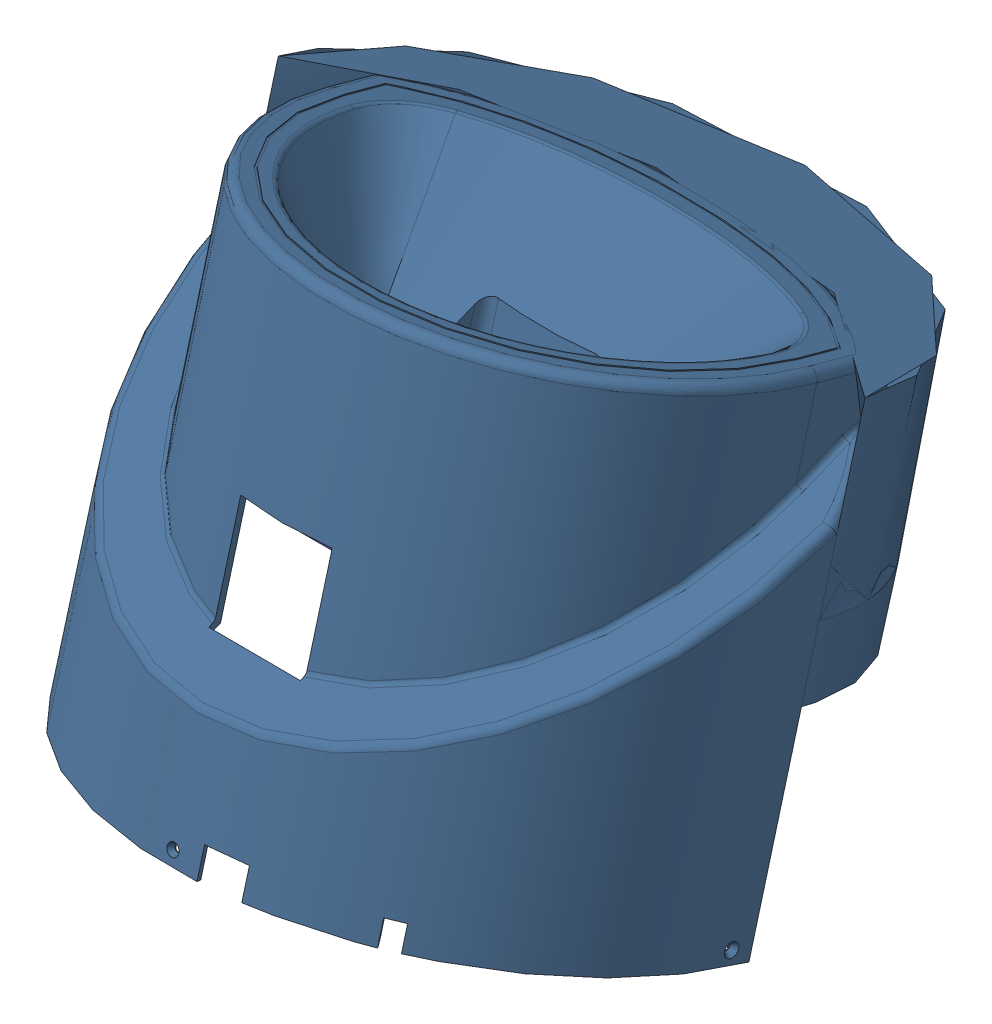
SolidWorks assembly Trieur de pièces.SLDASM, configuration Défaut (file format 12000). Lengths in mm.
Overall size (138 76.71 121.86).
26 component instances, 17 part files, 12 mates.
Components (placement in the parent):
- Sous ensemble fixe-1: Sous ensemble fixe.SLDASM [Défaut] at origin size (333.57 313.9 348.88)
  - 01 - Support-1: 01 - Support.SLDPRT [Défaut] at origin size (111.5 42.98 115)
  - 03a - Moteur-1: 03a - Moteur.SLDPRT [Défaut] at (53 -9 -55) x (0 -0.707107 -0.707107) z (1 0 0) size (24 24 36)
  - 04 - Embase moteur-1: 04 - Embase moteur.SLDPRT [Défaut] at (53 -9 -55) x (0 0.707107 0.707107) z (-1 0 0) size (38 24 2.5)
  - 05 - Vis à tête fraisée-1: 05 - Vis à tête fraisée.SLDPRT [ST 2,2 - 5,5 C] at (52 -4.0503 -50.0503) x (0 0.707107 0.707107) z (0 -0.707107 0.707107) size (4.9 4.2 4.9)
  - 05 - Vis à tête fraisée-2: 05 - Vis à tête fraisée.SLDPRT [ST 2,2 - 5,5 C] at (52 -13.9497 -59.9497) x (0 0.707107 0.707107) z (0 -0.707107 0.707107) size (4.9 4.2 4.9)
  - 06 - Vis à tôle ST2,9x8-1: 06 - Vis à tôle ST2,9x8.SLDPRT [ST 2,2 - 8C] at (53 1.9602 -44.0398) x (0 -1 0) z (0 0 1) size (5.6 9.84 5.6)
  - 06 - Vis à tôle ST2,9x8-2: 06 - Vis à tôle ST2,9x8.SLDPRT [ST 2,2 - 8C] at (53 -19.9602 -65.9602) x (0 0 -1) z (0 -1 0) size (5.6 9.84 5.6)
  - 12 - Axe mobiles-1: 12 - Axe mobiles.SLDPRT [Défaut] at (32.5 -17.6094 -36.5057) x (0 0 -1) z (1 0 0) size (4 4 18)
  - 12 - Axe mobiles-2: 12 - Axe mobiles.SLDPRT [Défaut] at (32.5 -17.6094 -14.0057) x (0 0 -1) z (1 0 0) size (4 4 18)
  - 12 - Axe mobiles-3: 12 - Axe mobiles.SLDPRT [Défaut] at (32.5 0 0) x (0 0 -1) z (1 0 0) size (4 4 18)
  - 14 - Plaque-1: 14 - Plaque.SLDPRT [Défaut] at (50.5 -16 -28) x (0 0 1) z (1 0 0) size (48 28 2.5)
  - 15 - Vis à tôle ST2,9x6-1: 15 - Vis à tôle ST2,9x6.SLDPRT [ST 2,2 - 6C] at (53 -16 -28) x (0 0 -1) z (0 -1 0) size (8 7.78 8)
  - 06 - Vis à tôle ST2,9x8-3: 06 - Vis à tôle ST2,9x8.SLDPRT [ST 2,2 - 8C] at (53 2 -24) x (0 -1 0) z (0 0 1) size (5.6 9.84 5.6)
  - 06 - Vis à tôle ST2,9x8-4: 06 - Vis à tôle ST2,9x8.SLDPRT [ST 2,2 - 8C] at (53 -8 -7) x (0 0 -1) z (0 -1 0) size (5.6 9.84 5.6)
  - 13 - Axe bec verseur-1: 13 - Axe bec verseur.SLDPRT [Défaut] at (-33 0 0) x (0 0 1) z (-1 0 0) size (4 4 8)
  - Corps-1: Corps.SLDPRT [Défaut] at (-0.2201 -157.3414 -30.2056) x (-0.999988 0 -0.004909) z (0.004742 -0.258819 -0.965914) size (331.87 246.33 293.5) (hidden)
- Sous ensemble moteur-1: Sous ensemble moteur.SLDASM [Défaut] at (0 29.5415 -14.7439) x (1 0 0) z (0 0.565834 0.824519) size (43 7.71 7.71)
  - 03b - Axe de pignon-1: 03b - Axe de pignon.SLDPRT [Défaut] at (63 -9 -55) x (0 0.524837 0.851203) z (1 0 0) size (2 2 43)
  - 07 - Pignon moteur-1: 07 - Pignon moteur.SLDPRT [Défaut] at (41.5 -9 -55) x (0 0.524837 0.851203) z (1 0 0) size (5.6 5.6 5.5)
- Sous ensemble mobile 1-1: Sous ensemble mobile 1.SLDPRT [Défaut] at (47.5 -17.6094 -36.5057) x (0 0.9651 0.261881) z (-1 0 0) size (36.79 36.8 13)
- Sous ensemble mobile 2-1: Sous ensemble mobile 2.SLDPRT [Défaut] at (43.5 -17.6094 -14.0057) x (0 0.993171 0.11667) z (-1 0 0) size (34.5 34.5 13)
- Sous ensemble bec verseur-1: Sous ensemble bec verseur.SLDASM [Défaut] at (1 0 0) x (1 0 0) z (0 -0.908098 0.418758) size (85 53.63 59.74)
  - 10 - Secteur denté-1: 10 - Secteur denté.SLDPRT [Défaut] at (37.5 0 0) x (0 0.340413 0.940276) z (1 0 0) size (31.32 19.5 9)
  - 11 - Vis à tôle ST2,2x5,5-1: 11 - Vis à tôle ST2,2x5,5.SLDPRT [ST 2,2 - 5,5 C] at (40.5 -0.9774 10.9565) x (0 0.340413 0.940276) z (0 0.940276 -0.340413) size (3.8 6.73 3.8)
  - 02 - Bec verseur-1: 02 - Bec verseur.SLDPRT [Défaut] at (-0.5 0 0) x (-1 0 0) z (0 -0.785384 0.619009) size (76 34.63 41)
Mates (geometry in assembly coordinates):
- Coïncidente1: coincident aligned: line of Sous ensemble fixe-1/03a - Moteur-1 through (79.5 -9 -55) axis (-1 0 0); line of Sous ensemble moteur-1/03b - Axe de pignon-1 through (84.3 -9 -55) axis (-1 0 0)
- Coïncidente2: coincident anti-aligned: line of Sous ensemble fixe-1/12 - Axe mobiles-1 through (50.3 -17.6094 -36.5057) axis (-1 0 0); line of Sous ensemble mobile 1-1 through (38 -17.6094 -36.5057) axis (1 0 0)
- Coïncidente3: coincident anti-aligned: line of Sous ensemble fixe-1/12 - Axe mobiles-2 through (50.3 -17.6094 -14.0057) axis (-1 0 0); line of Sous ensemble mobile 2-1 through (36 -17.6094 -14.0057) axis (1 0 0)
- Coïncidente4: coincident aligned: line of Sous ensemble fixe-1/12 - Axe mobiles-3 through (0 17.6 50.3) axis (0 0 -1); line of Sous ensemble bec verseur-1/10 - Secteur denté-1 through (47.5 0 0) axis (-1 0 0)
- Distance1: distance = 0.5 mm aligned: plane of Sous ensemble fixe-1/03a - Moteur-1 through (84 -9 -55) normal (1 0 0); plane of Sous ensemble moteur-1/03b - Axe de pignon-1 through (84.5 -9 -55) normal (1 0 0)
- Coïncidente5: coincident anti-aligned: plane of Sous ensemble fixe-1/01 - Support-1 through (47.5 -18 -67) normal (-1 0 0); plane of Sous ensemble mobile 1-1 through (47.5 -17.6094 -36.5057) normal (1 0 0)
- Coïncidente6: coincident anti-aligned: plane of Sous ensemble fixe-1/01 - Support-1 through (47.5 -18 -67) normal (-1 0 0); plane of Sous ensemble mobile 2-1 through (47.5 -17.6094 -14.0057) normal (1 0 0)
- Coïncidente7: coincident anti-aligned: plane of Sous ensemble fixe-1/01 - Support-1 through (47.5 -18 -67) normal (-1 0 0); plane of Sous ensemble bec verseur-1/10 - Secteur denté-1 through (47.5 0 0) normal (1 0 0)
- Contr.Engrenages1: gear: circle of Sous ensemble moteur-1/07 - Pignon moteur-1; circle of Sous ensemble mobile 1-1
- Contr.Engrenages2: gear: circle of Sous ensemble mobile 1-1; circle of Sous ensemble mobile 2-1
- Contr.Engrenages3: gear: circle of Sous ensemble mobile 2-1; circle of Sous ensemble bec verseur-1/10 - Secteur denté-1
- Angle1: planar angle = 1.884956 rad aligned: plane of Sous ensemble bec verseur-1/02 - Bec verseur-1 through (-37.5 1.8541 5.7063) normal (0 0.309017 0.951057); plane of Sous ensemble fixe-1/01 - Support-1 through (34.5 7 -71) normal (0 -1 0)
